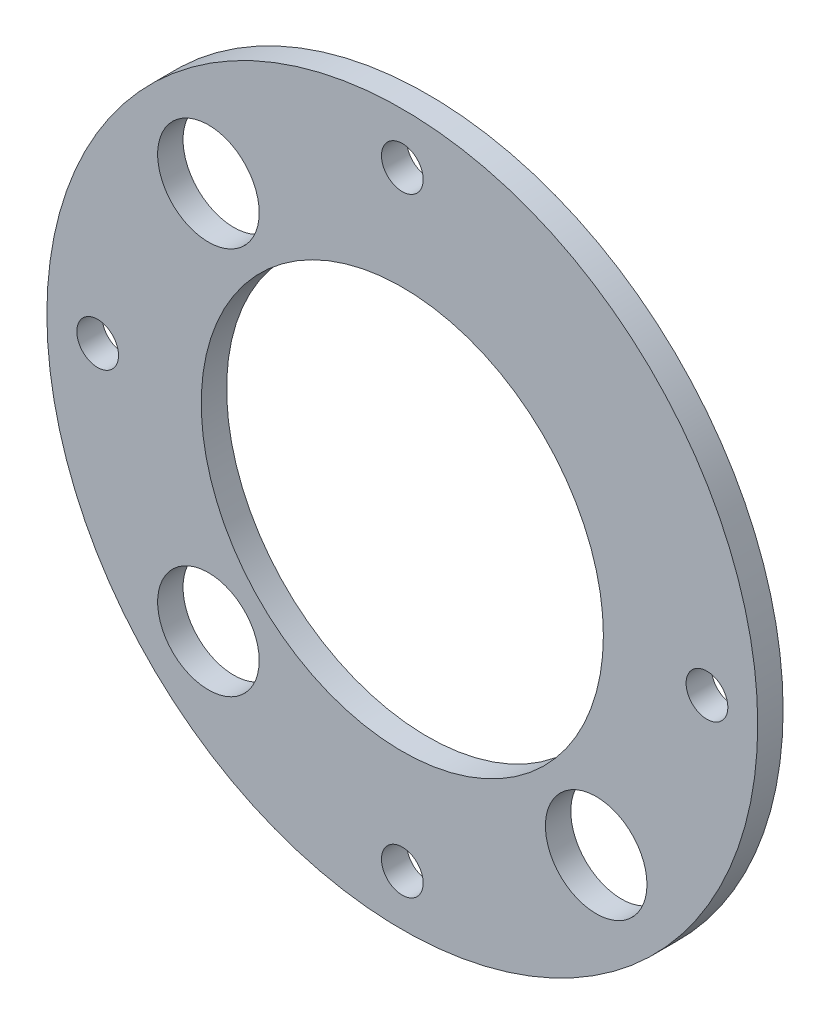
from build123d import *

# Parameters (mm, degrees)
SKETCH1_R                   = 44.45
SKETCH1_R_2                 = 25.146
BOSS_EXTRUDE1_DEPTH         = 3.175
F_5_0_2055_DIAMETER_HOLE1_D = 5.2197
SKETCH5_R                   = 6.35
CUT_EXTRUDE1_DEPTH          = 63.941922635


with BuildPart() as part:
    # Sketch1 → Boss-Extrude1 (new body)
    with BuildSketch(Plane.XY):
        Circle(SKETCH1_R)
        Circle(SKETCH1_R_2, mode=Mode.SUBTRACT)
    extrude(amount=BOSS_EXTRUDE1_DEPTH)

    # 5 _0.2055_ Diameter Hole1 (through all)
    with Locations(Plane(origin=(0, 0, 0), x_dir=(-1, 0, 0), z_dir=(0, 0, -1))):
        with Locations((0, 38.1), (38.1, 0), (0, -38.1), (-38.1, 0)):
            Hole(F_5_0_2055_DIAMETER_HOLE1_D / 2)

    # Sketch5 → Cut-Extrude1 (cut, through all)
    with BuildSketch(Plane.XY.offset(3.175)):
        with Locations((24.246691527, -24.246691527)):
            Circle(SKETCH5_R)
        with Locations((-24.246691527, -24.246691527)):
            Circle(SKETCH5_R)
        with Locations((-24.246691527, 24.246691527)):
            Circle(SKETCH5_R)
    extrude(amount=-CUT_EXTRUDE1_DEPTH, mode=Mode.SUBTRACT)


solid = part.part
